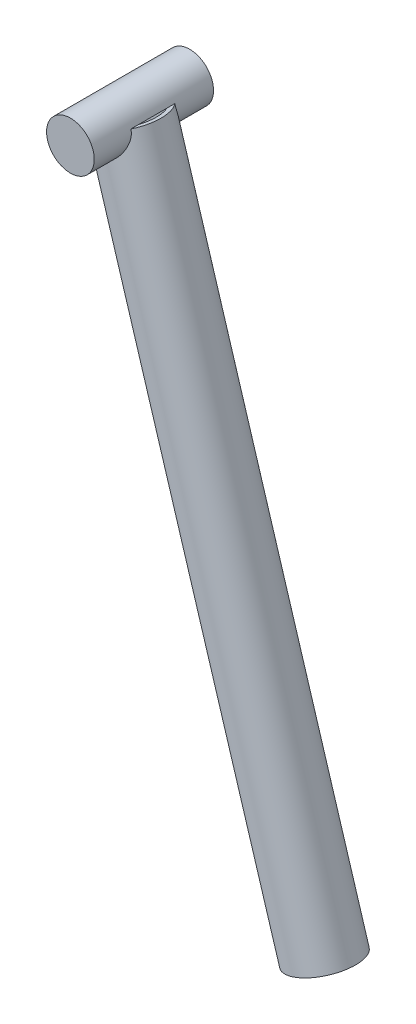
ISO-10303-21;
HEADER;
FILE_DESCRIPTION(('STEP AP214'),'2;1');
FILE_NAME('part.step','',(''),(''),'','','');
FILE_SCHEMA(('AUTOMOTIVE_DESIGN { 1 0 10303 214 1 1 1 1 }'));
ENDSEC;
DATA;
#1=APPLICATION_CONTEXT('core data for automotive mechanical design processes');
#2=APPLICATION_PROTOCOL_DEFINITION('international standard','automotive_design',2000,#1);
#3=PRODUCT_CONTEXT('',#1,'mechanical');
#4=PRODUCT('Part','Part','',(#3));
#5=PRODUCT_RELATED_PRODUCT_CATEGORY('part','',(#4));
#6=PRODUCT_DEFINITION_FORMATION('','',#4);
#7=PRODUCT_DEFINITION_CONTEXT('part definition',#1,'design');
#8=PRODUCT_DEFINITION('design','',#6,#7);
#9=PRODUCT_DEFINITION_SHAPE('','',#8);
#10=(LENGTH_UNIT() NAMED_UNIT(*) SI_UNIT(.MILLI.,.METRE.));
#11=(NAMED_UNIT(*) PLANE_ANGLE_UNIT() SI_UNIT($,.RADIAN.));
#12=(NAMED_UNIT(*) SI_UNIT($,.STERADIAN.) SOLID_ANGLE_UNIT());
#13=UNCERTAINTY_MEASURE_WITH_UNIT(LENGTH_MEASURE(1.E-05),#10,'distance_accuracy_value','');
#14=(GEOMETRIC_REPRESENTATION_CONTEXT(3) GLOBAL_UNCERTAINTY_ASSIGNED_CONTEXT((#13)) GLOBAL_UNIT_ASSIGNED_CONTEXT((#10,
#11,#12)) REPRESENTATION_CONTEXT('',''));
#15=CARTESIAN_POINT('',(0.,0.,0.));
#16=DIRECTION('',(0.,0.,1.));
#17=DIRECTION('',(1.,0.,0.));
#18=AXIS2_PLACEMENT_3D('',#15,#16,#17);
#19=CARTESIAN_POINT('',(-197.16571647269,644.9,0.));
#20=DIRECTION('',(-0.292371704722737,0.956304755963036,0.));
#21=DIRECTION('',(-0.956304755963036,-0.292371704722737,0.));
#22=AXIS2_PLACEMENT_3D('',#19,#20,#21);
#23=PLANE('',#22);
#24=CARTESIAN_POINT('',(-197.165716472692,644.9,0.));
#25=DIRECTION('',(-0.292371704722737,0.956304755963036,0.));
#26=DIRECTION('',(-0.956304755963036,-0.292371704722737,0.));
#27=AXIS2_PLACEMENT_3D('',#24,#25,#26);
#28=CIRCLE('',#27,11.6);
#29=CARTESIAN_POINT('',(-206.72876403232,641.976282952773,-5.87877538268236));
#30=VERTEX_POINT('',#29);
#31=CARTESIAN_POINT('',(-206.728764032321,641.976282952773,5.87877538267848));
#32=VERTEX_POINT('',#31);
#33=EDGE_CURVE('E109',#30,#32,#28,.T.);
#34=ORIENTED_EDGE('',*,*,#33,.F.);
#35=DIRECTION('',(0.,0.,1.));
#36=VECTOR('',#35,1.);
#37=CARTESIAN_POINT('',(-206.728764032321,641.976282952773,-25.));
#38=LINE('',#37,#36);
#39=CARTESIAN_POINT('',(-206.728764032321,641.976282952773,-9.21737489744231));
#40=VERTEX_POINT('',#39);
#41=EDGE_CURVE('E124',#40,#30,#38,.T.);
#42=ORIENTED_EDGE('',*,*,#41,.F.);
#43=CARTESIAN_POINT('',(-197.16571647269,644.9,0.));
#44=DIRECTION('',(-0.292371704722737,0.956304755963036,0.));
#45=DIRECTION('',(-0.956304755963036,-0.292371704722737,0.));
#46=AXIS2_PLACEMENT_3D('',#43,#44,#45);
#47=CIRCLE('',#46,13.6);
#48=CARTESIAN_POINT('',(-206.728764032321,641.976282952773,9.21737489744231));
#49=VERTEX_POINT('',#48);
#50=EDGE_CURVE('E146',#40,#49,#47,.T.);
#51=ORIENTED_EDGE('',*,*,#50,.T.);
#52=EDGE_CURVE('E121',#32,#49,#38,.T.);
#53=ORIENTED_EDGE('',*,*,#52,.F.);
#54=EDGE_LOOP('',(#34,#42,#51,#53));
#55=FACE_BOUND('',#54,.T.);
#56=ADVANCED_FACE('F52',(#55),#23,.T.);
#57=CARTESIAN_POINT('',(-115.633009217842,378.218530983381,0.));
#58=DIRECTION('',(-0.292371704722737,0.956304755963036,0.));
#59=DIRECTION('',(-0.956304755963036,-0.292371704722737,0.));
#60=AXIS2_PLACEMENT_3D('',#57,#58,#59);
#61=PLANE('',#60);
#62=CARTESIAN_POINT('',(-115.633009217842,378.218530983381,0.));
#63=DIRECTION('',(-0.292371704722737,0.956304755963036,0.));
#64=DIRECTION('',(-0.956304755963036,-0.292371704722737,0.));
#65=AXIS2_PLACEMENT_3D('',#62,#63,#64);
#66=CIRCLE('',#65,11.6);
#67=CARTESIAN_POINT('',(-126.726144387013,374.827019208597,0.));
#68=VERTEX_POINT('',#67);
#69=EDGE_CURVE('E111',#68,#68,#66,.F.);
#70=ORIENTED_EDGE('',*,*,#69,.F.);
#71=EDGE_LOOP('',(#70));
#72=FACE_BOUND('',#71,.T.);
#73=CARTESIAN_POINT('',(-115.633009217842,378.218530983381,0.));
#74=DIRECTION('',(-0.292371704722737,0.956304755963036,0.));
#75=DIRECTION('',(-0.956304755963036,-0.292371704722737,0.));
#76=AXIS2_PLACEMENT_3D('',#73,#74,#75);
#77=CIRCLE('',#76,13.6);
#78=CARTESIAN_POINT('',(-128.63875389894,374.242275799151,0.));
#79=VERTEX_POINT('',#78);
#80=EDGE_CURVE('E144',#79,#79,#77,.T.);
#81=ORIENTED_EDGE('',*,*,#80,.F.);
#82=EDGE_LOOP('',(#81));
#83=FACE_BOUND('',#82,.T.);
#84=ADVANCED_FACE('F54',(#72,#83),#61,.F.);
#85=CARTESIAN_POINT('',(-187.60266891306,647.823717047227,5.87877538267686));
#86=VERTEX_POINT('',#85);
#87=CARTESIAN_POINT('',(-187.60266891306,647.823717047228,-5.87877538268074));
#88=VERTEX_POINT('',#87);
#89=EDGE_CURVE('E73',#86,#88,#28,.T.);
#90=ORIENTED_EDGE('',*,*,#89,.F.);
#91=DIRECTION('',(0.,0.,1.));
#92=VECTOR('',#91,1.);
#93=CARTESIAN_POINT('',(-187.60266891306,647.823717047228,-25.));
#94=LINE('',#93,#92);
#95=CARTESIAN_POINT('',(-187.60266891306,647.823717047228,9.21737489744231));
#96=VERTEX_POINT('',#95);
#97=EDGE_CURVE('E104',#96,#86,#94,.F.);
#98=ORIENTED_EDGE('',*,*,#97,.F.);
#99=CARTESIAN_POINT('',(-187.60266891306,647.823717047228,-9.21737489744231));
#100=VERTEX_POINT('',#99);
#101=EDGE_CURVE('E149',#96,#100,#47,.T.);
#102=ORIENTED_EDGE('',*,*,#101,.T.);
#103=EDGE_CURVE('E105',#88,#100,#94,.F.);
#104=ORIENTED_EDGE('',*,*,#103,.F.);
#105=EDGE_LOOP('',(#90,#98,#102,#104));
#106=FACE_BOUND('',#105,.T.);
#107=ADVANCED_FACE('F114',(#106),#23,.T.);
#108=CARTESIAN_POINT('',(-115.633009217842,378.218530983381,0.));
#109=DIRECTION('',(-0.292371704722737,0.956304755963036,0.));
#110=DIRECTION('',(-0.956304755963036,-0.292371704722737,0.));
#111=AXIS2_PLACEMENT_3D('',#108,#109,#110);
#112=CYLINDRICAL_SURFACE('',#111,13.6);
#113=CARTESIAN_POINT('',(-206.728764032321,641.976282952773,9.21737489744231));
#114=CARTESIAN_POINT('',(-206.69403799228,641.862690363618,9.21736694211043));
#115=CARTESIAN_POINT('',(-206.657289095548,641.749739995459,9.21967227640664));
#116=CARTESIAN_POINT('',(-206.57986241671,641.525399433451,9.22883204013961));
#117=CARTESIAN_POINT('',(-206.539185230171,641.414009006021,9.23568578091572));
#118=CARTESIAN_POINT('',(-206.41160543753,641.083021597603,9.26291484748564));
#119=CARTESIAN_POINT('',(-206.319002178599,640.866110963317,9.28995869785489));
#120=CARTESIAN_POINT('',(-206.121136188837,640.44420148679,9.35987812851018));
#121=CARTESIAN_POINT('',(-206.016042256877,640.23908935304,9.40255590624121));
#122=CARTESIAN_POINT('',(-205.793537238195,639.839059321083,9.50168813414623));
#123=CARTESIAN_POINT('',(-205.676120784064,639.644145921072,9.55814860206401));
#124=CARTESIAN_POINT('',(-205.431105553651,639.266742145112,9.68201864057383));
#125=CARTESIAN_POINT('',(-205.30358952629,639.084169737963,9.7493431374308));
#126=CARTESIAN_POINT('',(-205.038624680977,638.730218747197,9.89293829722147));
#127=CARTESIAN_POINT('',(-204.90117673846,638.558839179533,9.96920817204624));
#128=CARTESIAN_POINT('',(-204.474044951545,638.060389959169,10.2087870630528));
#129=CARTESIAN_POINT('',(-204.170292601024,637.7501057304,10.3824810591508));
#130=CARTESIAN_POINT('',(-203.658706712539,637.29030491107,10.6702769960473));
#131=CARTESIAN_POINT('',(-203.461280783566,637.126230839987,10.7803304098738));
#132=CARTESIAN_POINT('',(-203.055111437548,636.814173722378,11.0025624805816));
#133=CARTESIAN_POINT('',(-202.846367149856,636.666191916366,11.1147413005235));
#134=CARTESIAN_POINT('',(-202.417979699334,636.386527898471,11.3389333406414));
#135=CARTESIAN_POINT('',(-202.198330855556,636.254854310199,11.4509464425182));
#136=CARTESIAN_POINT('',(-201.748672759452,636.008304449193,11.6726451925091));
#137=CARTESIAN_POINT('',(-201.518663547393,635.893428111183,11.7823308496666));
#138=CARTESIAN_POINT('',(-201.003329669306,635.660553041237,12.0181788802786));
#139=CARTESIAN_POINT('',(-200.715905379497,635.546241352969,12.1434289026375));
#140=CARTESIAN_POINT('',(-200.128053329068,635.343787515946,12.3845145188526));
#141=CARTESIAN_POINT('',(-199.827622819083,635.255650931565,12.5003481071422));
#142=CARTESIAN_POINT('',(-199.215918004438,635.107372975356,12.7191603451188));
#143=CARTESIAN_POINT('',(-198.904662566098,635.047185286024,12.8221600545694));
#144=CARTESIAN_POINT('',(-198.273173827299,634.956401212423,13.012330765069));
#145=CARTESIAN_POINT('',(-197.952945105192,634.925790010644,13.0995096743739));
#146=CARTESIAN_POINT('',(-197.401001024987,634.900142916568,13.2323632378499));
#147=CARTESIAN_POINT('',(-197.170747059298,634.897328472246,13.2827235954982));
#148=CARTESIAN_POINT('',(-196.708596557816,634.907781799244,13.3730990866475));
#149=CARTESIAN_POINT('',(-196.476700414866,634.921045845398,13.4131166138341));
#150=CARTESIAN_POINT('',(-196.012914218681,634.963942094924,13.4819810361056));
#151=CARTESIAN_POINT('',(-195.781024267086,634.993563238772,13.5108354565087));
#152=CARTESIAN_POINT('',(-195.318748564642,635.069254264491,13.5567990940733));
#153=CARTESIAN_POINT('',(-195.088362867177,635.115324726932,13.5739078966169));
#154=CARTESIAN_POINT('',(-194.630305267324,635.223883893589,13.5960248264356));
#155=CARTESIAN_POINT('',(-194.402641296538,635.286412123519,13.6010035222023));
#156=CARTESIAN_POINT('',(-193.952369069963,635.427405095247,13.598661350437));
#157=CARTESIAN_POINT('',(-193.729760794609,635.505869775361,13.5913405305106));
#158=CARTESIAN_POINT('',(-193.291237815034,635.678073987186,13.5645629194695));
#159=CARTESIAN_POINT('',(-193.075324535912,635.771816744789,13.5451035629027));
#160=CARTESIAN_POINT('',(-192.651760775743,635.973676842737,13.4944778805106));
#161=CARTESIAN_POINT('',(-192.444110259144,636.081794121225,13.4633116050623));
#162=CARTESIAN_POINT('',(-192.044687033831,636.30779016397,13.39107792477));
#163=CARTESIAN_POINT('',(-191.852621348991,636.425260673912,13.3503486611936));
#164=CARTESIAN_POINT('',(-191.478354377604,636.671747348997,13.2592744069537));
#165=CARTESIAN_POINT('',(-191.296156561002,636.800767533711,13.2089260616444));
#166=CARTESIAN_POINT('',(-190.942480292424,637.069251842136,13.099521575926));
#167=CARTESIAN_POINT('',(-190.770999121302,637.208713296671,13.0404676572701));
#168=CARTESIAN_POINT('',(-190.439179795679,637.497158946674,12.9145833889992));
#169=CARTESIAN_POINT('',(-190.278845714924,637.646146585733,12.8477502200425));
#170=CARTESIAN_POINT('',(-189.952819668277,637.96945627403,12.699640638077));
#171=CARTESIAN_POINT('',(-189.788462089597,638.144766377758,12.6175840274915));
#172=CARTESIAN_POINT('',(-189.474225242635,638.504837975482,12.4465339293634));
#173=CARTESIAN_POINT('',(-189.324352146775,638.689603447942,12.3575375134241));
#174=CARTESIAN_POINT('',(-189.039239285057,639.067637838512,12.1740180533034));
#175=CARTESIAN_POINT('',(-188.904006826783,639.260910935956,12.0794922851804));
#176=CARTESIAN_POINT('',(-188.648325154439,639.655074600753,11.8863954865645));
#177=CARTESIAN_POINT('',(-188.52787766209,639.85596605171,11.7878239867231));
#178=CARTESIAN_POINT('',(-188.280129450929,640.303932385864,11.568950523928));
#179=CARTESIAN_POINT('',(-188.155947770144,640.552473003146,11.4481078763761));
#180=CARTESIAN_POINT('',(-187.928788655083,641.058628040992,11.205389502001));
#181=CARTESIAN_POINT('',(-187.825815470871,641.316244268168,11.0835135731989));
#182=CARTESIAN_POINT('',(-187.641309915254,641.840119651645,10.8415124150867));
#183=CARTESIAN_POINT('',(-187.559794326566,642.10638539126,10.721388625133));
#184=CARTESIAN_POINT('',(-187.418852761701,642.646865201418,10.4862380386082));
#185=CARTESIAN_POINT('',(-187.359421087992,642.921077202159,10.371209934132));
#186=CARTESIAN_POINT('',(-187.273555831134,643.418525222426,10.1732490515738));
#187=CARTESIAN_POINT('',(-187.242811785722,643.640359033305,10.0886526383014));
#188=CARTESIAN_POINT('',(-187.196164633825,644.088367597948,9.92707783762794));
#189=CARTESIAN_POINT('',(-187.1802615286,644.314542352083,9.8500994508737));
#190=CARTESIAN_POINT('',(-187.163983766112,644.769684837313,9.7064135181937));
#191=CARTESIAN_POINT('',(-187.163545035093,644.998637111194,9.63966473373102));
#192=CARTESIAN_POINT('',(-187.178711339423,645.459253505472,9.51855898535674));
#193=CARTESIAN_POINT('',(-187.194309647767,645.690916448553,9.46419683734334));
#194=CARTESIAN_POINT('',(-187.234492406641,646.081591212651,9.38522353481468));
#195=CARTESIAN_POINT('',(-187.254640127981,646.24027240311,9.35664933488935));
#196=CARTESIAN_POINT('',(-187.302751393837,646.557607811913,9.30706443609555));
#197=CARTESIAN_POINT('',(-187.330712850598,646.716262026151,9.28605172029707));
#198=CARTESIAN_POINT('',(-187.394706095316,647.033955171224,9.25203304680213));
#199=CARTESIAN_POINT('',(-187.430792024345,647.192989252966,9.23908310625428));
#200=CARTESIAN_POINT('',(-187.510844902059,647.509643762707,9.22172966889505));
#201=CARTESIAN_POINT('',(-187.554817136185,647.667263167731,9.21733192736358));
#202=CARTESIAN_POINT('',(-187.60266891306,647.823717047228,9.21737489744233));
#203=B_SPLINE_CURVE_WITH_KNOTS('',3,(#113,#114,#115,#116,#117,#118,#119,#120,#121,#122,#123,
#124,#125,#126,#127,#128,#129,#130,#131,#132,#133,#134,#135,#136,#137,#138,#139,#140,#141,#142,
#143,#144,#145,#146,#147,#148,#149,#150,#151,#152,#153,#154,#155,#156,#157,#158,#159,#160,#161,
#162,#163,#164,#165,#166,#167,#168,#169,#170,#171,#172,#173,#174,#175,#176,#177,#178,#179,#180,
#181,#182,#183,#184,#185,#186,#187,#188,#189,#190,#191,#192,#193,#194,#195,#196,#197,#198,#199,
#200,#201,#202),.UNSPECIFIED.,.F.,.F.,(4,2,2,2,2,2,2,2,2,2,2,2,2,2,2,2,2,2,2,2,2,2,2,2,2,2,2,2,
2,2,2,2,2,2,2,2,2,2,2,2,2,2,2,2,4),(0.,0.356260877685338,0.712467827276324,1.4233283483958,
2.12548920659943,2.82795718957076,3.52516979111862,4.22232101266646,5.62068601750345,
6.45804759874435,7.2954736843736,8.13334071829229,8.97120449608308,9.97099204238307,
10.9709919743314,11.9693287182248,12.9671650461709,13.6735996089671,14.3798705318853,
15.0856645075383,15.7914833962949,16.4990131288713,17.2065401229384,17.9142167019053,
18.6218902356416,19.3075508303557,19.9934509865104,20.6791763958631,21.3651511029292,
22.1262084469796,22.8875886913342,23.6493472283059,24.4111943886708,25.3192133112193,
26.2274140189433,27.13632296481,28.0449972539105,28.7626460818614,29.4802949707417,
30.1949700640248,30.9093454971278,31.3964825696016,31.8834896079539,32.3738434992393,
32.8645272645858),.UNSPECIFIED.);
#204=EDGE_CURVE('E12',#49,#96,#203,.T.);
#205=ORIENTED_EDGE('',*,*,#204,.F.);
#206=ORIENTED_EDGE('',*,*,#50,.F.);
#207=CARTESIAN_POINT('',(-187.60266891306,647.823717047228,-9.21737489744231));
#208=CARTESIAN_POINT('',(-187.567937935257,647.710125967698,-9.21736694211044));
#209=CARTESIAN_POINT('',(-187.535243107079,647.595936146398,-9.21967227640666));
#210=CARTESIAN_POINT('',(-187.473983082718,647.366652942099,-9.22883204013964));
#211=CARTESIAN_POINT('',(-187.445417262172,647.251559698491,-9.23568578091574));
#212=CARTESIAN_POINT('',(-187.366099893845,646.905816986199,-9.26291484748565));
#213=CARTESIAN_POINT('',(-187.321576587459,646.674206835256,-9.28995869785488));
#214=CARTESIAN_POINT('',(-187.249686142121,646.213782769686,-9.35987812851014));
#215=CARTESIAN_POINT('',(-187.222115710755,645.98496932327,-9.40255590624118));
#216=CARTESIAN_POINT('',(-187.182886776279,645.528906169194,-9.5016881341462));
#217=CARTESIAN_POINT('',(-187.171235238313,645.301657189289,-9.55814860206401));
#218=CARTESIAN_POINT('',(-187.163320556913,644.851764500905,-9.68201864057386));
#219=CARTESIAN_POINT('',(-187.166942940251,644.629099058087,-9.74934313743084));
#220=CARTESIAN_POINT('',(-187.188681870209,644.187493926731,-9.89293829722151));
#221=CARTESIAN_POINT('',(-187.206797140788,643.968553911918,-9.96920817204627));
#222=CARTESIAN_POINT('',(-187.282176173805,643.316471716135,-10.2087870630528));
#223=CARTESIAN_POINT('',(-187.360489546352,642.88937827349,-10.3824810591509));
#224=CARTESIAN_POINT('',(-187.527496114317,642.222110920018,-10.6702769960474));
#225=CARTESIAN_POINT('',(-187.599420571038,641.975688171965,-10.7803304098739));
#226=CARTESIAN_POINT('',(-187.761650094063,641.489854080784,-11.0025624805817));
#227=CARTESIAN_POINT('',(-187.851956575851,641.250443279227,-11.1147413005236));
#228=CARTESIAN_POINT('',(-188.050719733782,640.779040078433,-11.3389333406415));
#229=CARTESIAN_POINT('',(-188.159185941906,640.547051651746,-11.4509464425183));
#230=CARTESIAN_POINT('',(-188.394100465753,640.091206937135,-11.6726451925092));
#231=CARTESIAN_POINT('',(-188.520548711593,639.86735061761,-11.7823308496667));
#232=CARTESIAN_POINT('',(-188.817557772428,639.386117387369,-12.0181788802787));
#233=CARTESIAN_POINT('',(-188.991921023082,639.130623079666,-12.1434289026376));
#234=CARTESIAN_POINT('',(-189.366061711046,638.634058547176,-12.3845145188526));
#235=CARTESIAN_POINT('',(-189.565844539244,638.392991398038,-12.5003481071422));
#236=CARTESIAN_POINT('',(-189.990054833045,637.92800240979,-12.7191603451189));
#237=CARTESIAN_POINT('',(-190.21444075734,637.704052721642,-12.8221600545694));
#238=CARTESIAN_POINT('',(-190.687202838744,637.275665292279,-13.0123307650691));
#239=CARTESIAN_POINT('',(-190.93556691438,637.071217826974,-13.099509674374));
#240=CARTESIAN_POINT('',(-191.378807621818,636.741312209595,-13.2323632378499));
#241=CARTESIAN_POINT('',(-191.568122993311,636.610222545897,-13.2827235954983));
#242=CARTESIAN_POINT('',(-191.95710854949,636.360457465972,-13.3730990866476));
#243=CARTESIAN_POINT('',(-192.156776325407,636.241779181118,-13.4131166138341));
#244=CARTESIAN_POINT('',(-192.565259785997,636.017995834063,-13.4819810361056));
#245=CARTESIAN_POINT('',(-192.774069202,635.912881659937,-13.5108354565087));
#246=CARTESIAN_POINT('',(-193.199639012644,635.717131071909,-13.5567990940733));
#247=CARTESIAN_POINT('',(-193.416399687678,635.626495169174,-13.5739078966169));
#248=CARTESIAN_POINT('',(-193.856852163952,635.460352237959,-13.5960248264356));
#249=CARTESIAN_POINT('',(-194.080559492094,635.384882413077,-13.6010035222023));
#250=CARTESIAN_POINT('',(-194.532694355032,635.249981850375,-13.598661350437));
#251=CARTESIAN_POINT('',(-194.761121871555,635.190551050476,-13.5913405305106));
#252=CARTESIAN_POINT('',(-195.220969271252,635.088095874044,-13.5645629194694));
#253=CARTESIAN_POINT('',(-195.452389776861,635.045074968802,-13.5451035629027));
#254=CARTESIAN_POINT('',(-195.91641878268,634.975570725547,-13.4944778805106));
#255=CARTESIAN_POINT('',(-196.149027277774,634.949087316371,-13.4633116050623));
#256=CARTESIAN_POINT('',(-196.606539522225,634.91309189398,-13.3910779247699));
#257=CARTESIAN_POINT('',(-196.831457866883,634.903077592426,-13.3503486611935));
#258=CARTESIAN_POINT('',(-197.279572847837,634.898136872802,-13.2592744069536));
#259=CARTESIAN_POINT('',(-197.502768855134,634.903215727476,-13.2089260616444));
#260=CARTESIAN_POINT('',(-197.946114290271,634.928026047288,-13.099521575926));
#261=CARTESIAN_POINT('',(-198.166264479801,634.94775377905,-13.04046765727));
#262=CARTESIAN_POINT('',(-198.60265192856,635.001335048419,-12.9145833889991));
#263=CARTESIAN_POINT('',(-198.818887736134,635.035193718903,-12.8477502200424));
#264=CARTESIAN_POINT('',(-199.269968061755,635.120918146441,-12.699640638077));
#265=CARTESIAN_POINT('',(-199.504258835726,635.174349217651,-12.6175840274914));
#266=CARTESIAN_POINT('',(-199.966122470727,635.297143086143,-12.4465339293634));
#267=CARTESIAN_POINT('',(-200.193692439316,635.366512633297,-12.357537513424));
#268=CARTESIAN_POINT('',(-200.641455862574,635.520484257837,-12.1740180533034));
#269=CARTESIAN_POINT('',(-200.861645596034,635.605093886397,-12.0794922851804));
#270=CARTESIAN_POINT('',(-201.294028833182,635.788894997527,-11.8863954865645));
#271=CARTESIAN_POINT('',(-201.506221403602,635.888088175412,-11.787823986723));
#272=CARTESIAN_POINT('',(-201.962113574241,636.120930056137,-11.568950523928));
#273=CARTESIAN_POINT('',(-202.204047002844,636.257538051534,-11.448107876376));
#274=CARTESIAN_POINT('',(-202.675408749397,636.550133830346,-11.2053895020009));
#275=CARTESIAN_POINT('',(-202.90483455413,636.706125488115,-11.0835135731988));
#276=CARTESIAN_POINT('',(-203.350743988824,637.037263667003,-10.8415124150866));
#277=CARTESIAN_POINT('',(-203.567217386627,637.212425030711,-10.7213886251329));
#278=CARTESIAN_POINT('',(-203.986295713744,637.581689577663,-10.4862380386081));
#279=CARTESIAN_POINT('',(-204.188904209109,637.775787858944,-10.3712099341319));
#280=CARTESIAN_POINT('',(-204.538259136,638.140175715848,-10.1732490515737));
#281=CARTESIAN_POINT('',(-204.687794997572,638.306892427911,-10.0886526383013));
#282=CARTESIAN_POINT('',(-204.976990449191,638.652223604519,-9.92707783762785));
#283=CARTESIAN_POINT('',(-205.116650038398,638.830838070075,-9.85009945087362));
#284=CARTESIAN_POINT('',(-205.384657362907,639.19906588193,-9.70641351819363));
#285=CARTESIAN_POINT('',(-205.513049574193,639.388630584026,-9.63966473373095));
#286=CARTESIAN_POINT('',(-205.75804955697,639.778979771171,-9.51855898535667));
#287=CARTESIAN_POINT('',(-205.874662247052,639.979759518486,-9.46419683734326));
#288=CARTESIAN_POINT('',(-206.059811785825,640.326113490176,-9.38522353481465));
#289=CARTESIAN_POINT('',(-206.131841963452,640.468932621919,-9.35664933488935));
#290=CARTESIAN_POINT('',(-206.269407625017,640.758919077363,-9.30706443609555));
#291=CARTESIAN_POINT('',(-206.334944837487,640.906085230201,-9.28605172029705));
#292=CARTESIAN_POINT('',(-206.459543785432,641.205249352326,-9.25203304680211));
#293=CARTESIAN_POINT('',(-206.518557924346,641.357273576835,-9.23908310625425));
#294=CARTESIAN_POINT('',(-206.629262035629,641.664557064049,-9.22172966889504));
#295=CARTESIAN_POINT('',(-206.680947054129,641.819818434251,-9.21733192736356));
#296=CARTESIAN_POINT('',(-206.728764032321,641.976282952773,-9.2173748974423));
#297=B_SPLINE_CURVE_WITH_KNOTS('',3,(#207,#208,#209,#210,#211,#212,#213,#214,#215,#216,#217,
#218,#219,#220,#221,#222,#223,#224,#225,#226,#227,#228,#229,#230,#231,#232,#233,#234,#235,#236,
#237,#238,#239,#240,#241,#242,#243,#244,#245,#246,#247,#248,#249,#250,#251,#252,#253,#254,#255,
#256,#257,#258,#259,#260,#261,#262,#263,#264,#265,#266,#267,#268,#269,#270,#271,#272,#273,#274,
#275,#276,#277,#278,#279,#280,#281,#282,#283,#284,#285,#286,#287,#288,#289,#290,#291,#292,#293,
#294,#295,#296),.UNSPECIFIED.,.F.,.F.,(4,2,2,2,2,2,2,2,2,2,2,2,2,2,2,2,2,2,2,2,2,2,2,2,2,2,2,2,
2,2,2,2,2,2,2,2,2,2,2,2,2,2,2,2,4),(0.,0.356260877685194,0.712467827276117,1.42332834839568,
2.12548920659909,2.82795718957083,3.52516979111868,4.22232101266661,5.62068601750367,
6.45804759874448,7.29547368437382,8.13334071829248,8.97120449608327,9.97099204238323,
10.9709919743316,11.969328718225,12.9671650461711,13.6735996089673,14.3798705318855,
15.0856645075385,15.7914833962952,16.4990131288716,17.2065401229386,17.9142167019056,
18.6218902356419,19.307550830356,19.9934509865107,20.6791763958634,21.3651511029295,
22.1262084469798,22.8875886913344,23.649347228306,24.411194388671,25.3192133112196,
26.2274140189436,27.1363229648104,28.0449972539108,28.7626460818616,29.480294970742,
30.1949700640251,30.9093454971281,31.3964825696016,31.8834896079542,32.3738434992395,
32.8645272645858),.UNSPECIFIED.);
#298=EDGE_CURVE('E66',#100,#40,#297,.T.);
#299=ORIENTED_EDGE('',*,*,#298,.F.);
#300=ORIENTED_EDGE('',*,*,#101,.F.);
#301=EDGE_LOOP('',(#205,#206,#299,#300));
#302=FACE_BOUND('',#301,.T.);
#303=ORIENTED_EDGE('',*,*,#80,.T.);
#304=EDGE_LOOP('',(#303));
#305=FACE_BOUND('',#304,.T.);
#306=ADVANCED_FACE('F155',(#302,#305),#112,.T.);
#307=CARTESIAN_POINT('',(-197.16571647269,644.9,-25.));
#308=DIRECTION('',(0.,0.,1.));
#309=DIRECTION('',(1.,0.,0.));
#310=AXIS2_PLACEMENT_3D('',#307,#308,#309);
#311=PLANE('',#310);
#312=CARTESIAN_POINT('',(-197.16571647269,644.9,-25.));
#313=DIRECTION('',(0.,0.,1.));
#314=DIRECTION('',(1.,0.,0.));
#315=AXIS2_PLACEMENT_3D('',#312,#313,#314);
#316=CIRCLE('',#315,10.);
#317=CARTESIAN_POINT('',(-187.16571647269,644.9,-25.));
#318=VERTEX_POINT('',#317);
#319=EDGE_CURVE('E130',#318,#318,#316,.T.);
#320=ORIENTED_EDGE('',*,*,#319,.F.);
#321=EDGE_LOOP('',(#320));
#322=FACE_BOUND('',#321,.T.);
#323=ADVANCED_FACE('F166',(#322),#311,.F.);
#324=CARTESIAN_POINT('',(-197.16571647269,644.9,25.));
#325=DIRECTION('',(0.,0.,1.));
#326=DIRECTION('',(1.,0.,0.));
#327=AXIS2_PLACEMENT_3D('',#324,#325,#326);
#328=PLANE('',#327);
#329=CARTESIAN_POINT('',(-197.16571647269,644.9,25.));
#330=DIRECTION('',(0.,0.,1.));
#331=DIRECTION('',(1.,0.,0.));
#332=AXIS2_PLACEMENT_3D('',#329,#330,#331);
#333=CIRCLE('',#332,10.);
#334=CARTESIAN_POINT('',(-187.16571647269,644.9,25.));
#335=VERTEX_POINT('',#334);
#336=EDGE_CURVE('E126',#335,#335,#333,.T.);
#337=ORIENTED_EDGE('',*,*,#336,.T.);
#338=EDGE_LOOP('',(#337));
#339=FACE_BOUND('',#338,.T.);
#340=ADVANCED_FACE('F162',(#339),#328,.T.);
#341=CARTESIAN_POINT('',(-197.16571647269,644.9,-25.));
#342=DIRECTION('',(0.,0.,1.));
#343=DIRECTION('',(1.,0.,0.));
#344=AXIS2_PLACEMENT_3D('',#341,#342,#343);
#345=CYLINDRICAL_SURFACE('',#344,10.);
#346=ORIENTED_EDGE('',*,*,#41,.T.);
#347=EDGE_CURVE('E122',#30,#32,#38,.T.);
#348=ORIENTED_EDGE('',*,*,#347,.T.);
#349=ORIENTED_EDGE('',*,*,#52,.T.);
#350=ORIENTED_EDGE('',*,*,#204,.T.);
#351=ORIENTED_EDGE('',*,*,#97,.T.);
#352=EDGE_CURVE('E98',#86,#88,#94,.F.);
#353=ORIENTED_EDGE('',*,*,#352,.T.);
#354=ORIENTED_EDGE('',*,*,#103,.T.);
#355=ORIENTED_EDGE('',*,*,#298,.T.);
#356=EDGE_LOOP('',(#346,#348,#349,#350,#351,#353,#354,#355));
#357=FACE_BOUND('',#356,.T.);
#358=ORIENTED_EDGE('',*,*,#336,.F.);
#359=EDGE_LOOP('',(#358));
#360=FACE_BOUND('',#359,.T.);
#361=ORIENTED_EDGE('',*,*,#319,.T.);
#362=EDGE_LOOP('',(#361));
#363=FACE_BOUND('',#362,.T.);
#364=ADVANCED_FACE('F118',(#357,#360,#363),#345,.T.);
#365=CARTESIAN_POINT('',(-197.165716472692,644.9,0.));
#366=DIRECTION('',(-0.292371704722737,0.956304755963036,0.));
#367=DIRECTION('',(-0.956304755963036,-0.292371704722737,0.));
#368=AXIS2_PLACEMENT_3D('',#365,#366,#367);
#369=PLANE('',#368);
#370=ORIENTED_EDGE('',*,*,#347,.F.);
#371=EDGE_CURVE('E100',#88,#30,#28,.T.);
#372=ORIENTED_EDGE('',*,*,#371,.F.);
#373=ORIENTED_EDGE('',*,*,#352,.F.);
#374=EDGE_CURVE('E80',#32,#86,#28,.T.);
#375=ORIENTED_EDGE('',*,*,#374,.F.);
#376=EDGE_LOOP('',(#370,#372,#373,#375));
#377=FACE_BOUND('',#376,.T.);
#378=ADVANCED_FACE('F99',(#377),#369,.F.);
#379=CARTESIAN_POINT('',(-114.817682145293,375.551716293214,0.));
#380=DIRECTION('',(-0.292371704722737,0.956304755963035,0.));
#381=DIRECTION('',(-0.956304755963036,-0.292371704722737,0.));
#382=AXIS2_PLACEMENT_3D('',#379,#380,#381);
#383=CYLINDRICAL_SURFACE('',#382,11.6);
#384=ORIENTED_EDGE('',*,*,#69,.T.);
#385=EDGE_LOOP('',(#384));
#386=FACE_BOUND('',#385,.T.);
#387=ORIENTED_EDGE('',*,*,#374,.T.);
#388=ORIENTED_EDGE('',*,*,#89,.T.);
#389=ORIENTED_EDGE('',*,*,#371,.T.);
#390=ORIENTED_EDGE('',*,*,#33,.T.);
#391=EDGE_LOOP('',(#387,#388,#389,#390));
#392=FACE_BOUND('',#391,.T.);
#393=ADVANCED_FACE('F107',(#386,#392),#383,.F.);
#394=CLOSED_SHELL('',(#56,#84,#107,#306,#323,#340,#364,#378,#393));
#395=MANIFOLD_SOLID_BREP('B2',#394);
#396=ADVANCED_BREP_SHAPE_REPRESENTATION('',(#18,#395),#14);
#397=SHAPE_DEFINITION_REPRESENTATION(#9,#396);
ENDSEC;
END-ISO-10303-21;
